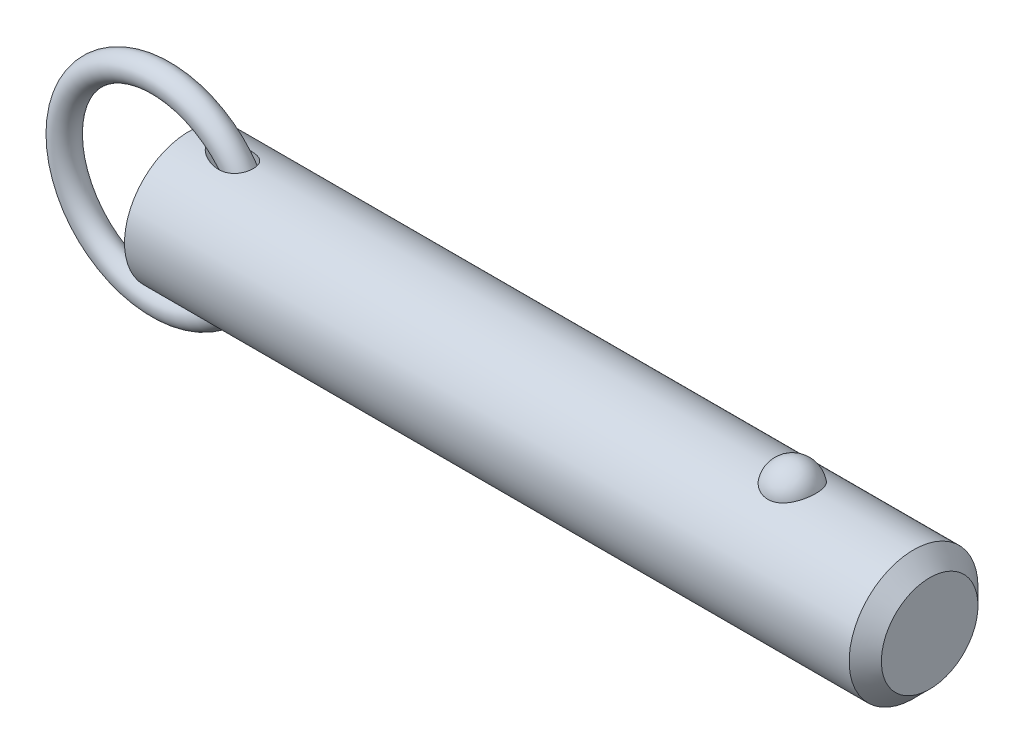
ISO-10303-21;
HEADER;
FILE_DESCRIPTION(('STEP AP214'),'2;1');
FILE_NAME('part.step','',(''),(''),'','','');
FILE_SCHEMA(('AUTOMOTIVE_DESIGN { 1 0 10303 214 1 1 1 1 }'));
ENDSEC;
DATA;
#1=APPLICATION_CONTEXT('core data for automotive mechanical design processes');
#2=APPLICATION_PROTOCOL_DEFINITION('international standard','automotive_design',2000,#1);
#3=PRODUCT_CONTEXT('',#1,'mechanical');
#4=PRODUCT('Part','Part','',(#3));
#5=PRODUCT_RELATED_PRODUCT_CATEGORY('part','',(#4));
#6=PRODUCT_DEFINITION_FORMATION('','',#4);
#7=PRODUCT_DEFINITION_CONTEXT('part definition',#1,'design');
#8=PRODUCT_DEFINITION('design','',#6,#7);
#9=PRODUCT_DEFINITION_SHAPE('','',#8);
#10=(LENGTH_UNIT() NAMED_UNIT(*) SI_UNIT(.MILLI.,.METRE.));
#11=(NAMED_UNIT(*) PLANE_ANGLE_UNIT() SI_UNIT($,.RADIAN.));
#12=(NAMED_UNIT(*) SI_UNIT($,.STERADIAN.) SOLID_ANGLE_UNIT());
#13=UNCERTAINTY_MEASURE_WITH_UNIT(LENGTH_MEASURE(1.E-05),#10,'distance_accuracy_value','');
#14=(GEOMETRIC_REPRESENTATION_CONTEXT(3) GLOBAL_UNCERTAINTY_ASSIGNED_CONTEXT((#13)) GLOBAL_UNIT_ASSIGNED_CONTEXT((#10,
#11,#12)) REPRESENTATION_CONTEXT('',''));
#15=CARTESIAN_POINT('',(0.,0.,0.));
#16=DIRECTION('',(0.,0.,1.));
#17=DIRECTION('',(1.,0.,0.));
#18=AXIS2_PLACEMENT_3D('',#15,#16,#17);
#19=CARTESIAN_POINT('',(-5.53898640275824,0.,0.));
#20=DIRECTION('',(0.,0.,1.));
#21=DIRECTION('',(1.,0.,0.));
#22=AXIS2_PLACEMENT_3D('',#19,#20,#21);
#23=TOROIDAL_SURFACE('',#22,19.05,2.54);
#24=CARTESIAN_POINT('',(16.0510135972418,0.,0.));
#25=VERTEX_POINT('',#24);
#26=VERTEX_LOOP('',#25);
#27=FACE_BOUND('',#26,.T.);
#28=ADVANCED_FACE('P0_F12',(#27),#23,.T.);
#29=CLOSED_SHELL('',(#28));
#30=MANIFOLD_SOLID_BREP('P0_B1',#29);
#31=CARTESIAN_POINT('',(0.,0.,0.));
#32=DIRECTION('',(1.,0.,0.));
#33=DIRECTION('',(0.,0.,-1.));
#34=AXIS2_PLACEMENT_3D('',#31,#32,#33);
#35=CYLINDRICAL_SURFACE('',#34,12.7);
#36=CARTESIAN_POINT('',(142.875,0.,0.));
#37=DIRECTION('',(1.,0.,0.));
#38=DIRECTION('',(0.,0.,-1.));
#39=AXIS2_PLACEMENT_3D('',#36,#37,#38);
#40=CIRCLE('',#39,12.7);
#41=CARTESIAN_POINT('',(142.875,0.,-12.7));
#42=VERTEX_POINT('',#41);
#43=EDGE_CURVE('P1_E89',#42,#42,#40,.T.);
#44=ORIENTED_EDGE('',*,*,#43,.F.);
#45=EDGE_LOOP('',(#44));
#46=FACE_BOUND('',#45,.T.);
#47=CARTESIAN_POINT('',(0.,0.,0.));
#48=DIRECTION('',(1.,0.,0.));
#49=DIRECTION('',(0.,0.,-1.));
#50=AXIS2_PLACEMENT_3D('',#47,#48,#49);
#51=CIRCLE('',#50,12.7);
#52=CARTESIAN_POINT('',(0.,0.,-12.7));
#53=VERTEX_POINT('',#52);
#54=EDGE_CURVE('P1_E52',#53,#53,#51,.T.);
#55=ORIENTED_EDGE('',*,*,#54,.T.);
#56=EDGE_LOOP('',(#55));
#57=FACE_BOUND('',#56,.T.);
#58=CARTESIAN_POINT('',(118.960042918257,11.7500437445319,4.81938502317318));
#59=CARTESIAN_POINT('',(118.835088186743,11.7500430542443,4.81938571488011));
#60=CARTESIAN_POINT('',(118.710144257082,11.7520975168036,4.81438658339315));
#61=CARTESIAN_POINT('',(118.461142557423,11.760253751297,4.79442904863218));
#62=CARTESIAN_POINT('',(118.337085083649,11.7663568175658,4.77946746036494));
#63=CARTESIAN_POINT('',(118.090901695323,11.7824262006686,4.7397141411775));
#64=CARTESIAN_POINT('',(117.968774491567,11.7923898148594,4.71492928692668));
#65=CARTESIAN_POINT('',(117.727187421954,11.8158938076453,4.65571340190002));
#66=CARTESIAN_POINT('',(117.60772859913,11.8294355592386,4.6212786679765));
#67=CARTESIAN_POINT('',(117.372557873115,11.8596812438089,4.54309502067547));
#68=CARTESIAN_POINT('',(117.256839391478,11.8763792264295,4.49936361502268));
#69=CARTESIAN_POINT('',(117.029653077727,11.9124878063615,4.40287235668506));
#70=CARTESIAN_POINT('',(116.918186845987,11.9318994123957,4.35010914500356));
#71=CARTESIAN_POINT('',(116.591278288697,11.9934256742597,4.17881316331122));
#72=CARTESIAN_POINT('',(116.383127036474,12.038858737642,4.04720756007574));
#73=CARTESIAN_POINT('',(115.985850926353,12.1352173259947,3.748564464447));
#74=CARTESIAN_POINT('',(115.797443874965,12.1862630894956,3.58061821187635));
#75=CARTESIAN_POINT('',(115.450521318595,12.2875163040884,3.21600758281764));
#76=CARTESIAN_POINT('',(115.292011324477,12.3377235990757,3.0193379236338));
#77=CARTESIAN_POINT('',(115.00168878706,12.434492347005,2.592916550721));
#78=CARTESIAN_POINT('',(114.871376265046,12.4807925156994,2.36208286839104));
#79=CARTESIAN_POINT('',(114.649407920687,12.5623454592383,1.88070399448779));
#80=CARTESIAN_POINT('',(114.557755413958,12.5975972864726,1.63015711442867));
#81=CARTESIAN_POINT('',(114.414046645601,12.6538414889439,1.1129886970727));
#82=CARTESIAN_POINT('',(114.362499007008,12.6746503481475,0.846205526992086));
#83=CARTESIAN_POINT('',(114.301977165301,12.699153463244,0.307085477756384));
#84=CARTESIAN_POINT('',(114.293001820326,12.7028481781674,0.0347487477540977));
#85=CARTESIAN_POINT('',(114.317731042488,12.6927785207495,-0.506073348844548));
#86=CARTESIAN_POINT('',(114.351189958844,12.6791146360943,-0.77457186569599));
#87=CARTESIAN_POINT('',(114.459687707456,12.635882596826,-1.30170246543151));
#88=CARTESIAN_POINT('',(114.53472729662,12.606314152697,-1.5603343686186));
#89=CARTESIAN_POINT('',(114.72500006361,12.5342328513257,-2.06083899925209));
#90=CARTESIAN_POINT('',(114.840287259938,12.4917026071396,-2.3026886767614));
#91=CARTESIAN_POINT('',(115.108704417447,12.3981123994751,-2.76259600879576));
#92=CARTESIAN_POINT('',(115.261837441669,12.3470517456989,-2.98065173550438));
#93=CARTESIAN_POINT('',(115.603507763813,12.2416045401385,-3.38786328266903));
#94=CARTESIAN_POINT('',(115.792201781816,12.1872040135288,-3.57688418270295));
#95=CARTESIAN_POINT('',(116.200239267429,12.0814086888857,-3.91941073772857));
#96=CARTESIAN_POINT('',(116.419580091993,12.0300136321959,-4.07291945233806));
#97=CARTESIAN_POINT('',(116.878375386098,11.9373542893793,-4.33691289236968));
#98=CARTESIAN_POINT('',(117.117304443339,11.8958982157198,-4.44824125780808));
#99=CARTESIAN_POINT('',(117.61243761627,11.8268116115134,-4.62881985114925));
#100=CARTESIAN_POINT('',(117.868635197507,11.7991758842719,-4.69808589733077));
#101=CARTESIAN_POINT('',(118.377164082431,11.7622209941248,-4.78983181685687));
#102=CARTESIAN_POINT('',(118.629041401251,11.7520502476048,-4.81449025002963));
#103=CARTESIAN_POINT('',(119.133573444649,11.7485796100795,-4.82295735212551));
#104=CARTESIAN_POINT('',(119.386228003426,11.7552763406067,-4.80677420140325));
#105=CARTESIAN_POINT('',(119.876834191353,11.7842584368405,-4.73525430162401));
#106=CARTESIAN_POINT('',(120.114998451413,11.8060486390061,-4.68116061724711));
#107=CARTESIAN_POINT('',(120.578489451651,11.8622750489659,-4.53678133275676));
#108=CARTESIAN_POINT('',(120.803815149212,11.8967122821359,-4.44649279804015));
#109=CARTESIAN_POINT('',(121.240801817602,11.9754603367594,-4.2298761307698));
#110=CARTESIAN_POINT('',(121.452057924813,12.0199699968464,-4.10280539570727));
#111=CARTESIAN_POINT('',(121.850601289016,12.1138028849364,-3.81685409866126));
#112=CARTESIAN_POINT('',(122.037883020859,12.163127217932,-3.65796622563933));
#113=CARTESIAN_POINT('',(122.393350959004,12.2642343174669,-3.30364864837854));
#114=CARTESIAN_POINT('',(122.560111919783,12.3160165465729,-3.10678783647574));
#115=CARTESIAN_POINT('',(122.859579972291,12.4142566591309,-2.68748409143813));
#116=CARTESIAN_POINT('',(122.992280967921,12.4607135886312,-2.46503658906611));
#117=CARTESIAN_POINT('',(123.224691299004,12.5450236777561,-1.9928951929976));
#118=CARTESIAN_POINT('',(123.323215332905,12.5825557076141,-1.7425591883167));
#119=CARTESIAN_POINT('',(123.479227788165,12.6431720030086,-1.22773734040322));
#120=CARTESIAN_POINT('',(123.536715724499,12.6662560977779,-0.963251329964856));
#121=CARTESIAN_POINT('',(123.609544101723,12.6956486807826,-0.427355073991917));
#122=CARTESIAN_POINT('',(123.624837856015,12.7019385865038,-0.155937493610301));
#123=CARTESIAN_POINT('',(123.612779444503,12.6970201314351,0.385928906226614));
#124=CARTESIAN_POINT('',(123.58542805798,12.6858120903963,0.656377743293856));
#125=CARTESIAN_POINT('',(123.513060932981,12.6568455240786,1.05454017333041));
#126=CARTESIAN_POINT('',(123.483796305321,12.6451962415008,1.18577850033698));
#127=CARTESIAN_POINT('',(123.415022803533,12.6181819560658,1.44513808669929));
#128=CARTESIAN_POINT('',(123.375517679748,12.6028183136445,1.57326046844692));
#129=CARTESIAN_POINT('',(123.286439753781,12.5687547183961,1.82554978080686));
#130=CARTESIAN_POINT('',(123.236862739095,12.5500533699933,1.9497150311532));
#131=CARTESIAN_POINT('',(123.12792115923,12.5098093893,2.1931437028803));
#132=CARTESIAN_POINT('',(123.068560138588,12.4882677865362,2.31240887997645));
#133=CARTESIAN_POINT('',(122.93997128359,12.4427679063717,2.54593031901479));
#134=CARTESIAN_POINT('',(122.870688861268,12.4187964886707,2.66015396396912));
#135=CARTESIAN_POINT('',(122.722903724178,12.3691892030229,2.88202659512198));
#136=CARTESIAN_POINT('',(122.644404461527,12.3435539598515,2.98967802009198));
#137=CARTESIAN_POINT('',(122.478550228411,12.2912955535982,3.19774385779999));
#138=CARTESIAN_POINT('',(122.391191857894,12.2646720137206,3.29815546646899));
#139=CARTESIAN_POINT('',(122.208161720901,12.2111945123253,3.49095035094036));
#140=CARTESIAN_POINT('',(122.112493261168,12.1843406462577,3.58333679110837));
#141=CARTESIAN_POINT('',(121.913627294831,12.1312249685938,3.75922876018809));
#142=CARTESIAN_POINT('',(121.810450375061,12.104961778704,3.84275713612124));
#143=CARTESIAN_POINT('',(121.59701336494,12.0537284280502,4.00056406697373));
#144=CARTESIAN_POINT('',(121.486756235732,12.028757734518,4.07484645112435));
#145=CARTESIAN_POINT('',(121.259755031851,11.9808306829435,4.21367959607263));
#146=CARTESIAN_POINT('',(121.143006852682,11.9578756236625,4.27822410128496));
#147=CARTESIAN_POINT('',(120.90394258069,11.9147184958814,4.39698483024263));
#148=CARTESIAN_POINT('',(120.781628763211,11.894515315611,4.45120522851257));
#149=CARTESIAN_POINT('',(120.522952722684,11.8561129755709,4.55255353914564));
#150=CARTESIAN_POINT('',(120.386223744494,11.8381764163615,4.59884858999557));
#151=CARTESIAN_POINT('',(120.108608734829,11.8069093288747,4.67853897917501));
#152=CARTESIAN_POINT('',(119.967724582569,11.7935767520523,4.71194005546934));
#153=CARTESIAN_POINT('',(119.68309446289,11.7720277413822,4.76552188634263));
#154=CARTESIAN_POINT('',(119.539348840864,11.7638106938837,4.78570422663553));
#155=CARTESIAN_POINT('',(119.250411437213,11.7528195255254,4.81263433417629));
#156=CARTESIAN_POINT('',(119.105219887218,11.7500445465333,4.81938421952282));
#157=CARTESIAN_POINT('',(118.960042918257,11.7500437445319,4.81938502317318));
#158=B_SPLINE_CURVE_WITH_KNOTS('',3,(#58,#59,#60,#61,#62,#63,#64,#65,#66,#67,#68,#69,#70,#71,
#72,#73,#74,#75,#76,#77,#78,#79,#80,#81,#82,#83,#84,#85,#86,#87,#88,#89,#90,#91,#92,#93,#94,#95,
#96,#97,#98,#99,#100,#101,#102,#103,#104,#105,#106,#107,#108,#109,#110,#111,#112,#113,#114,#115,
#116,#117,#118,#119,#120,#121,#122,#123,#124,#125,#126,#127,#128,#129,#130,#131,#132,#133,#134,
#135,#136,#137,#138,#139,#140,#141,#142,#143,#144,#145,#146,#147,#148,#149,#150,#151,#152,#153,
#154,#155,#156,#157),.UNSPECIFIED.,.T.,.F.,(4,2,2,2,2,2,2,2,2,2,2,2,2,2,2,2,2,2,2,2,2,2,2,2,2,2,
2,2,2,2,2,2,2,2,2,2,2,2,2,2,2,2,2,2,2,2,2,2,2,4),(0.,0.374729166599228,0.749578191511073,
1.12416526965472,1.49889629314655,1.87292776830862,2.24709865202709,2.99481328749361,
3.76399449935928,4.53331735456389,5.3368391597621,6.14042986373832,6.95405296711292,
7.76765424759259,8.57656703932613,9.38549455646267,10.1955119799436,11.0055949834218,
11.8193353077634,12.6330054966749,13.4294141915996,14.2255231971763,14.9815786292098,
15.7374826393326,16.4696948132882,17.2019663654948,17.9501979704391,18.6986017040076,
19.484470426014,20.2704797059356,21.0815215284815,21.8925729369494,22.7045213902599,
23.5164550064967,23.9209608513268,24.3253187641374,24.7298461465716,25.1342272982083,
25.54092555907,25.9474719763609,26.3541750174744,26.7607169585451,27.1661834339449,
27.5714814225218,27.9770386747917,28.3824315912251,28.8181206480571,29.2536155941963,
29.6890582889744,30.1244323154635),.UNSPECIFIED.);
#159=CARTESIAN_POINT('',(118.960042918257,11.7500437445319,4.81938502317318));
#160=VERTEX_POINT('',#159);
#161=EDGE_CURVE('P1_E80',#160,#160,#158,.T.);
#162=ORIENTED_EDGE('',*,*,#161,.T.);
#163=EDGE_LOOP('',(#162));
#164=FACE_BOUND('',#163,.T.);
#165=CARTESIAN_POINT('',(-5.53898640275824,0.,0.));
#166=DIRECTION('',(0.796400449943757,-0.604769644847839,0.));
#167=DIRECTION('',(0.604769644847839,0.796400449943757,0.));
#168=AXIS2_PLACEMENT_3D('',#165,#166,#167);
#169=ELLIPSE('',#168,15.9467514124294,12.7);
#170=CARTESIAN_POINT('',(4.09482149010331,12.6864319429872,0.586893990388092));
#171=VERTEX_POINT('',#170);
#172=CARTESIAN_POINT('',(4.09482149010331,12.6864319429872,-0.586893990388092));
#173=VERTEX_POINT('',#172);
#174=EDGE_CURVE('P1_E47',#171,#173,#169,.F.);
#175=ORIENTED_EDGE('',*,*,#174,.T.);
#176=CARTESIAN_POINT('',(4.06153170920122,12.6905758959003,-0.48916605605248));
#177=CARTESIAN_POINT('',(4.08111374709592,12.6881366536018,-0.552489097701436));
#178=CARTESIAN_POINT('',(4.10417851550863,12.6852663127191,-0.614604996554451));
#179=CARTESIAN_POINT('',(4.1562843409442,12.6787965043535,-0.736067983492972));
#180=CARTESIAN_POINT('',(4.18531032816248,12.6751988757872,-0.795421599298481));
#181=CARTESIAN_POINT('',(4.27911159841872,12.6636052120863,-0.967590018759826));
#182=CARTESIAN_POINT('',(4.35123408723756,12.654730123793,-1.07635920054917));
#183=CARTESIAN_POINT('',(4.49106800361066,12.6376715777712,-1.25922957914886));
#184=CARTESIAN_POINT('',(4.5560106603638,12.6297947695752,-1.33556751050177));
#185=CARTESIAN_POINT('',(4.69223626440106,12.6134116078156,-1.48232741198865));
#186=CARTESIAN_POINT('',(4.7635214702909,12.6049050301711,-1.55274725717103));
#187=CARTESIAN_POINT('',(4.91163946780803,12.587417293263,-1.68868704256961));
#188=CARTESIAN_POINT('',(4.98851399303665,12.5784327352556,-1.75416062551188));
#189=CARTESIAN_POINT('',(5.14630057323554,12.560235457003,-1.88003275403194));
#190=CARTESIAN_POINT('',(5.22721398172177,12.5510226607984,-1.94042957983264));
#191=CARTESIAN_POINT('',(5.45368877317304,12.5256514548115,-2.09966332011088));
#192=CARTESIAN_POINT('',(5.60261616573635,12.5094182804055,-2.19371988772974));
#193=CARTESIAN_POINT('',(5.90795545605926,12.4774211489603,-2.36893890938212));
#194=CARTESIAN_POINT('',(6.06437232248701,12.4616575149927,-2.45009264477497));
#195=CARTESIAN_POINT('',(6.38306132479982,12.431227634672,-2.60008249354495));
#196=CARTESIAN_POINT('',(6.54533237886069,12.4165611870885,-2.66892086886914));
#197=CARTESIAN_POINT('',(6.87462618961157,12.3889351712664,-2.79435199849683));
#198=CARTESIAN_POINT('',(7.0416477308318,12.3759751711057,-2.85094785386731));
#199=CARTESIAN_POINT('',(7.38726647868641,12.3518460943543,-2.95377962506));
#200=CARTESIAN_POINT('',(7.56604577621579,12.3407843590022,-2.9994320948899));
#201=CARTESIAN_POINT('',(7.92698692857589,12.3219309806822,-3.07596683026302));
#202=CARTESIAN_POINT('',(8.10914972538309,12.314140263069,-3.1068449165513));
#203=CARTESIAN_POINT('',(8.47511457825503,12.3025918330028,-3.15226850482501));
#204=CARTESIAN_POINT('',(8.6589097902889,12.2988216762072,-3.16686440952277));
#205=CARTESIAN_POINT('',(9.02696087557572,12.2959421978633,-3.17802250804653));
#206=CARTESIAN_POINT('',(9.21121628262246,12.2968292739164,-3.17459864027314));
#207=CARTESIAN_POINT('',(9.61636263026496,12.3045198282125,-3.14471110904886));
#208=CARTESIAN_POINT('',(9.83695552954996,12.3125080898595,-3.1136323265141));
#209=CARTESIAN_POINT('',(10.1619126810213,12.3303028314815,-3.04206574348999));
#210=CARTESIAN_POINT('',(10.2692747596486,12.3372061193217,-3.01403983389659));
#211=CARTESIAN_POINT('',(10.4811758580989,12.3528538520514,-2.94925947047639));
#212=CARTESIAN_POINT('',(10.5857162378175,12.361597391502,-2.91250930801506));
#213=CARTESIAN_POINT('',(10.7921321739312,12.3808585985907,-2.82951748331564));
#214=CARTESIAN_POINT('',(10.8939665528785,12.3913944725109,-2.78317723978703));
#215=CARTESIAN_POINT('',(11.0926118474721,12.4138762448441,-2.68112002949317));
#216=CARTESIAN_POINT('',(11.1894254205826,12.4258213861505,-2.62540809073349));
#217=CARTESIAN_POINT('',(11.3768740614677,12.4507225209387,-2.50465655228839));
#218=CARTESIAN_POINT('',(11.46751150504,12.4636781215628,-2.43962056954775));
#219=CARTESIAN_POINT('',(11.641457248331,12.4901070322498,-2.30048560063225));
#220=CARTESIAN_POINT('',(11.7247669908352,12.5035802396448,-2.2263884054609));
#221=CARTESIAN_POINT('',(11.8713131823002,12.5285000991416,-2.08117367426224));
#222=CARTESIAN_POINT('',(11.9357009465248,12.5399538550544,-2.0112159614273));
#223=CARTESIAN_POINT('',(12.0576805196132,12.5624496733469,-1.86555293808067));
#224=CARTESIAN_POINT('',(12.1152732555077,12.5734917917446,-1.7898484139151));
#225=CARTESIAN_POINT('',(12.2230738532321,12.5947858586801,-1.63327883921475));
#226=CARTESIAN_POINT('',(12.2732844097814,12.6050380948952,-1.55241568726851));
#227=CARTESIAN_POINT('',(12.3658430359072,12.6243983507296,-1.38621267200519));
#228=CARTESIAN_POINT('',(12.4081916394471,12.6335064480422,-1.30087311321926));
#229=CARTESIAN_POINT('',(12.5150098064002,12.6569076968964,-1.05702619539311));
#230=CARTESIAN_POINT('',(12.5703399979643,12.6695746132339,-0.894232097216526));
#231=CARTESIAN_POINT('',(12.6526225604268,12.6886816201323,-0.561391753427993));
#232=CARTESIAN_POINT('',(12.6795825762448,12.6951233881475,-0.391347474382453));
#233=CARTESIAN_POINT('',(12.7041016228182,12.7009766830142,-0.0537636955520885));
#234=CARTESIAN_POINT('',(12.7024538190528,12.7005778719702,0.113714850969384));
#235=CARTESIAN_POINT('',(12.6717240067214,12.6932548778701,0.445979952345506));
#236=CARTESIAN_POINT('',(12.6426435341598,12.6863310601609,0.61076665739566));
#237=CARTESIAN_POINT('',(12.5579769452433,12.6667465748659,0.932429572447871));
#238=CARTESIAN_POINT('',(12.5024793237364,12.6541050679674,1.08933027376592));
#239=CARTESIAN_POINT('',(12.3665691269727,12.6244558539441,1.39146752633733));
#240=CARTESIAN_POINT('',(12.2861577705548,12.6074483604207,1.53670464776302));
#241=CARTESIAN_POINT('',(12.1018203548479,12.5706804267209,1.81319588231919));
#242=CARTESIAN_POINT('',(11.9976588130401,12.5508932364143,1.94428915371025));
#243=CARTESIAN_POINT('',(11.7695265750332,12.5107540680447,2.18776051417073));
#244=CARTESIAN_POINT('',(11.6455540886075,12.4904020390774,2.30013691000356));
#245=CARTESIAN_POINT('',(11.3759347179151,12.4502278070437,2.50870972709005));
#246=CARTESIAN_POINT('',(11.2295880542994,12.4304654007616,2.60400962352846));
#247=CARTESIAN_POINT('',(10.9239803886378,12.3941696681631,2.7716292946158));
#248=CARTESIAN_POINT('',(10.7647152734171,12.3776373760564,2.84394171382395));
#249=CARTESIAN_POINT('',(10.4192039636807,12.3473062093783,2.9730352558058));
#250=CARTESIAN_POINT('',(10.231933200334,12.3340204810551,3.02717164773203));
#251=CARTESIAN_POINT('',(9.85152982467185,12.3134301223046,3.10986173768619));
#252=CARTESIAN_POINT('',(9.65839336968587,12.3061295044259,3.13839827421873));
#253=CARTESIAN_POINT('',(9.31022514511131,12.2982822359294,3.16897517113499));
#254=CARTESIAN_POINT('',(9.15555718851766,12.2966525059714,3.1752689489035));
#255=CARTESIAN_POINT('',(8.84618945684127,12.2967963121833,3.17471335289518));
#256=CARTESIAN_POINT('',(8.69148970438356,12.2985715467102,3.16785742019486));
#257=CARTESIAN_POINT('',(8.38280471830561,12.3051648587,3.14214692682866));
#258=CARTESIAN_POINT('',(8.22882218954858,12.3099904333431,3.12326280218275));
#259=CARTESIAN_POINT('',(7.92276070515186,12.3222644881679,3.07448013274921));
#260=CARTESIAN_POINT('',(7.77068148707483,12.3297126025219,3.04458312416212));
#261=CARTESIAN_POINT('',(7.46452663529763,12.3470493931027,2.97350781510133));
#262=CARTESIAN_POINT('',(7.31052714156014,12.3570043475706,2.93201910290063));
#263=CARTESIAN_POINT('',(7.00579083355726,12.3787609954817,2.83876185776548));
#264=CARTESIAN_POINT('',(6.85505451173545,12.3905629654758,2.78699178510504));
#265=CARTESIAN_POINT('',(6.55781208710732,12.415528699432,2.6735774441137));
#266=CARTESIAN_POINT('',(6.41129783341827,12.4286895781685,2.61195394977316));
#267=CARTESIAN_POINT('',(6.12302950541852,12.4559398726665,2.47874512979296));
#268=CARTESIAN_POINT('',(5.981273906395,12.4700289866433,2.40716303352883));
#269=CARTESIAN_POINT('',(5.6707312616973,12.5020754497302,2.2355042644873));
#270=CARTESIAN_POINT('',(5.50343839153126,12.5201625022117,2.13268685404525));
#271=CARTESIAN_POINT('',(5.26147616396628,12.5471537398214,1.96522579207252));
#272=CARTESIAN_POINT('',(5.18224299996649,12.5561365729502,1.90713440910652));
#273=CARTESIAN_POINT('',(5.02746475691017,12.573912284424,1.78618989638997));
#274=CARTESIAN_POINT('',(4.95191912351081,12.5827051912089,1.72333748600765));
#275=CARTESIAN_POINT('',(4.81787163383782,12.598469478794,1.60360864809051));
#276=CARTESIAN_POINT('',(4.75865966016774,12.6054958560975,1.54753994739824));
#277=CARTESIAN_POINT('',(4.64406285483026,12.6191906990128,1.43158546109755));
#278=CARTESIAN_POINT('',(4.5886792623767,12.6258590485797,1.37169845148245));
#279=CARTESIAN_POINT('',(4.43014912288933,12.6450546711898,1.18656670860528));
#280=CARTESIAN_POINT('',(4.3337272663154,12.6568788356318,1.05507993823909));
#281=CARTESIAN_POINT('',(4.21252055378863,12.6718304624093,0.848052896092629));
#282=CARTESIAN_POINT('',(4.17660155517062,12.6762773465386,0.779100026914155));
#283=CARTESIAN_POINT('',(4.11264979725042,12.6842122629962,0.637080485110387));
#284=CARTESIAN_POINT('',(4.08466792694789,12.6876941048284,0.563990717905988));
#285=CARTESIAN_POINT('',(4.06153170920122,12.6905758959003,0.4891660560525));
#286=B_SPLINE_CURVE_WITH_KNOTS('',3,(#176,#177,#178,#179,#180,#181,#182,#183,#184,#185,#186,
#187,#188,#189,#190,#191,#192,#193,#194,#195,#196,#197,#198,#199,#200,#201,#202,#203,#204,#205,
#206,#207,#208,#209,#210,#211,#212,#213,#214,#215,#216,#217,#218,#219,#220,#221,#222,#223,#224,
#225,#226,#227,#228,#229,#230,#231,#232,#233,#234,#235,#236,#237,#238,#239,#240,#241,#242,#243,
#244,#245,#246,#247,#248,#249,#250,#251,#252,#253,#254,#255,#256,#257,#258,#259,#260,#261,#262,
#263,#264,#265,#266,#267,#268,#269,#270,#271,#272,#273,#274,#275,#276,#277,#278,#279,#280,#281,
#282,#283,#284,#285),.UNSPECIFIED.,.F.,.F.,(4,2,2,2,2,2,2,2,2,2,2,2,2,2,2,2,2,2,2,2,2,2,2,2,2,2,
2,2,2,2,2,2,2,2,2,2,2,2,2,2,2,2,2,2,2,2,2,2,2,2,2,2,2,2,4),(0.,0.198708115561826,
0.39691995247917,0.787580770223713,1.08882492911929,1.39017679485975,1.69407136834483,
1.99806847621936,2.52793143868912,3.05815092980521,3.58827293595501,4.11826050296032,
4.67218806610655,5.22627222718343,5.77863637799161,6.3305733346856,6.99657211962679,
7.32977411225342,7.66281254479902,7.99946156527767,8.33593054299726,8.67226935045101,
9.00854178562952,9.29544181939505,9.58230266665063,9.86905853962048,10.1557949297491,
10.6702338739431,11.1845341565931,11.6845985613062,12.1846349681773,12.6830079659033,
13.1813565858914,13.68487951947,14.1884479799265,14.713533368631,15.2387866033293,
15.8228373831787,16.407279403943,16.8710810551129,17.3351141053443,17.8002921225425,
18.2654052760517,18.7444169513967,19.2235004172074,19.7015868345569,20.1795185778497,
20.7699825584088,21.0658110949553,21.3615950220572,21.606957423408,21.8523988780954,
22.3397467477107,22.5729183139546,22.8075527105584),.UNSPECIFIED.);
#287=EDGE_CURVE('P1_E51',#173,#171,#286,.T.);
#288=ORIENTED_EDGE('',*,*,#287,.T.);
#289=EDGE_LOOP('',(#175,#288));
#290=FACE_BOUND('',#289,.T.);
#291=CARTESIAN_POINT('',(-5.53898640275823,0.,0.));
#292=DIRECTION('',(-0.796400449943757,-0.604769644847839,0.));
#293=DIRECTION('',(0.604769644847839,-0.796400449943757,0.));
#294=AXIS2_PLACEMENT_3D('',#291,#292,#293);
#295=ELLIPSE('',#294,15.9467514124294,12.7);
#296=CARTESIAN_POINT('',(4.09482149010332,-12.6864319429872,0.586893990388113));
#297=VERTEX_POINT('',#296);
#298=CARTESIAN_POINT('',(4.09482149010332,-12.6864319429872,-0.586893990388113));
#299=VERTEX_POINT('',#298);
#300=EDGE_CURVE('P1_E28',#297,#299,#295,.F.);
#301=ORIENTED_EDGE('',*,*,#300,.F.);
#302=CARTESIAN_POINT('',(4.06153170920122,-12.6905758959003,0.489166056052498));
#303=CARTESIAN_POINT('',(4.08111374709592,-12.6881366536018,0.552489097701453));
#304=CARTESIAN_POINT('',(4.10417851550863,-12.6852663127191,0.614604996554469));
#305=CARTESIAN_POINT('',(4.15628434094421,-12.6787965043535,0.736067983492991));
#306=CARTESIAN_POINT('',(4.18531032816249,-12.6751988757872,0.795421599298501));
#307=CARTESIAN_POINT('',(4.27911159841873,-12.6636052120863,0.967590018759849));
#308=CARTESIAN_POINT('',(4.35123408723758,-12.654730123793,1.07635920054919));
#309=CARTESIAN_POINT('',(4.49106800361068,-12.6376715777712,1.25922957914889));
#310=CARTESIAN_POINT('',(4.55601066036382,-12.6297947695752,1.3355675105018));
#311=CARTESIAN_POINT('',(4.69223626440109,-12.6134116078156,1.48232741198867));
#312=CARTESIAN_POINT('',(4.76352147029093,-12.6049050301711,1.55274725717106));
#313=CARTESIAN_POINT('',(4.91163946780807,-12.587417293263,1.68868704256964));
#314=CARTESIAN_POINT('',(4.98851399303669,-12.5784327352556,1.75416062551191));
#315=CARTESIAN_POINT('',(5.14630057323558,-12.560235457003,1.88003275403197));
#316=CARTESIAN_POINT('',(5.22721398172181,-12.5510226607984,1.94042957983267));
#317=CARTESIAN_POINT('',(5.45368877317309,-12.5256514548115,2.09966332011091));
#318=CARTESIAN_POINT('',(5.60261616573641,-12.5094182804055,2.19371988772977));
#319=CARTESIAN_POINT('',(5.90795545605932,-12.4774211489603,2.36893890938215));
#320=CARTESIAN_POINT('',(6.06437232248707,-12.4616575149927,2.450092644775));
#321=CARTESIAN_POINT('',(6.38306132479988,-12.431227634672,2.60008249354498));
#322=CARTESIAN_POINT('',(6.54533237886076,-12.4165611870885,2.66892086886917));
#323=CARTESIAN_POINT('',(6.87462618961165,-12.3889351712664,2.79435199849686));
#324=CARTESIAN_POINT('',(7.04164773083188,-12.3759751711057,2.85094785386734));
#325=CARTESIAN_POINT('',(7.38726647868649,-12.3518460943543,2.95377962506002));
#326=CARTESIAN_POINT('',(7.56604577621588,-12.3407843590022,2.99943209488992));
#327=CARTESIAN_POINT('',(7.92698692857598,-12.3219309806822,3.07596683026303));
#328=CARTESIAN_POINT('',(8.10914972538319,-12.314140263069,3.10684491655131));
#329=CARTESIAN_POINT('',(8.47511457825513,-12.3025918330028,3.15226850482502));
#330=CARTESIAN_POINT('',(8.65890979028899,-12.2988216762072,3.16686440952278));
#331=CARTESIAN_POINT('',(9.02696087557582,-12.2959421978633,3.17802250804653));
#332=CARTESIAN_POINT('',(9.21121628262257,-12.2968292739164,3.17459864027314));
#333=CARTESIAN_POINT('',(9.61636263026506,-12.3045198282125,3.14471110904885));
#334=CARTESIAN_POINT('',(9.83695552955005,-12.3125080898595,3.11363232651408));
#335=CARTESIAN_POINT('',(10.1619126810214,-12.3303028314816,3.04206574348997));
#336=CARTESIAN_POINT('',(10.2692747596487,-12.3372061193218,3.01403983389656));
#337=CARTESIAN_POINT('',(10.481175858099,-12.3528538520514,2.94925947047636));
#338=CARTESIAN_POINT('',(10.5857162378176,-12.361597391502,2.91250930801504));
#339=CARTESIAN_POINT('',(10.7921321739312,-12.3808585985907,2.82951748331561));
#340=CARTESIAN_POINT('',(10.8939665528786,-12.3913944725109,2.78317723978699));
#341=CARTESIAN_POINT('',(11.0926118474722,-12.4138762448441,2.68112002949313));
#342=CARTESIAN_POINT('',(11.1894254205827,-12.4258213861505,2.62540809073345));
#343=CARTESIAN_POINT('',(11.3768740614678,-12.4507225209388,2.50465655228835));
#344=CARTESIAN_POINT('',(11.4675115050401,-12.4636781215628,2.4396205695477));
#345=CARTESIAN_POINT('',(11.641457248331,-12.4901070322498,2.3004856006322));
#346=CARTESIAN_POINT('',(11.7247669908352,-12.5035802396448,2.22638840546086));
#347=CARTESIAN_POINT('',(11.8713131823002,-12.5285000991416,2.0811736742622));
#348=CARTESIAN_POINT('',(11.9357009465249,-12.5399538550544,2.01121596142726));
#349=CARTESIAN_POINT('',(12.0576805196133,-12.5624496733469,1.86555293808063));
#350=CARTESIAN_POINT('',(12.1152732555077,-12.5734917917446,1.78984841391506));
#351=CARTESIAN_POINT('',(12.2230738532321,-12.5947858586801,1.63327883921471));
#352=CARTESIAN_POINT('',(12.2732844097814,-12.6050380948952,1.55241568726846));
#353=CARTESIAN_POINT('',(12.3658430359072,-12.6243983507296,1.38621267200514));
#354=CARTESIAN_POINT('',(12.4081916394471,-12.6335064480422,1.30087311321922));
#355=CARTESIAN_POINT('',(12.5150098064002,-12.6569076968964,1.05702619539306));
#356=CARTESIAN_POINT('',(12.5703399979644,-12.6695746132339,0.89423209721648));
#357=CARTESIAN_POINT('',(12.6526225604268,-12.6886816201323,0.561391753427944));
#358=CARTESIAN_POINT('',(12.6795825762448,-12.6951233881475,0.391347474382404));
#359=CARTESIAN_POINT('',(12.7041016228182,-12.7009766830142,0.0537636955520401));
#360=CARTESIAN_POINT('',(12.7024538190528,-12.7005778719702,-0.113714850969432));
#361=CARTESIAN_POINT('',(12.6717240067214,-12.6932548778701,-0.445979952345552));
#362=CARTESIAN_POINT('',(12.6426435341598,-12.6863310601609,-0.610766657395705));
#363=CARTESIAN_POINT('',(12.5579769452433,-12.6667465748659,-0.932429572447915));
#364=CARTESIAN_POINT('',(12.5024793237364,-12.6541050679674,-1.08933027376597));
#365=CARTESIAN_POINT('',(12.3665691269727,-12.6244558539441,-1.39146752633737));
#366=CARTESIAN_POINT('',(12.2861577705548,-12.6074483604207,-1.53670464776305));
#367=CARTESIAN_POINT('',(12.1018203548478,-12.5706804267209,-1.81319588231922));
#368=CARTESIAN_POINT('',(11.99765881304,-12.5508932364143,-1.94428915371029));
#369=CARTESIAN_POINT('',(11.7695265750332,-12.5107540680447,-2.18776051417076));
#370=CARTESIAN_POINT('',(11.6455540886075,-12.4904020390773,-2.30013691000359));
#371=CARTESIAN_POINT('',(11.375934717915,-12.4502278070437,-2.50870972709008));
#372=CARTESIAN_POINT('',(11.2295880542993,-12.4304654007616,-2.60400962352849));
#373=CARTESIAN_POINT('',(10.9239803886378,-12.3941696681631,-2.77162929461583));
#374=CARTESIAN_POINT('',(10.764715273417,-12.3776373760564,-2.84394171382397));
#375=CARTESIAN_POINT('',(10.4192039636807,-12.3473062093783,-2.97303525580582));
#376=CARTESIAN_POINT('',(10.2319332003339,-12.3340204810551,-3.02717164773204));
#377=CARTESIAN_POINT('',(9.8515298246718,-12.3134301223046,-3.1098617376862));
#378=CARTESIAN_POINT('',(9.65839336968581,-12.3061295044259,-3.13839827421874));
#379=CARTESIAN_POINT('',(9.31022514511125,-12.2982822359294,-3.168975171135));
#380=CARTESIAN_POINT('',(9.1555571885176,-12.2966525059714,-3.1752689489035));
#381=CARTESIAN_POINT('',(8.84618945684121,-12.2967963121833,-3.17471335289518));
#382=CARTESIAN_POINT('',(8.6914897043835,-12.2985715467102,-3.16785742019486));
#383=CARTESIAN_POINT('',(8.38280471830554,-12.3051648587,-3.14214692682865));
#384=CARTESIAN_POINT('',(8.22882218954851,-12.3099904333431,-3.12326280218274));
#385=CARTESIAN_POINT('',(7.92276070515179,-12.3222644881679,-3.07448013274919));
#386=CARTESIAN_POINT('',(7.77068148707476,-12.329712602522,-3.04458312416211));
#387=CARTESIAN_POINT('',(7.46452663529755,-12.3470493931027,-2.97350781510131));
#388=CARTESIAN_POINT('',(7.31052714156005,-12.3570043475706,-2.93201910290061));
#389=CARTESIAN_POINT('',(7.00579083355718,-12.3787609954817,-2.83876185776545));
#390=CARTESIAN_POINT('',(6.85505451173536,-12.3905629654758,-2.78699178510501));
#391=CARTESIAN_POINT('',(6.55781208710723,-12.415528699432,-2.67357744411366));
#392=CARTESIAN_POINT('',(6.41129783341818,-12.4286895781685,-2.61195394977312));
#393=CARTESIAN_POINT('',(6.12302950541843,-12.4559398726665,-2.47874512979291));
#394=CARTESIAN_POINT('',(5.9812739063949,-12.4700289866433,-2.40716303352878));
#395=CARTESIAN_POINT('',(5.6707312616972,-12.5020754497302,-2.23550426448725));
#396=CARTESIAN_POINT('',(5.50343839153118,-12.5201625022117,-2.13268685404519));
#397=CARTESIAN_POINT('',(5.2614761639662,-12.5471537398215,-1.96522579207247));
#398=CARTESIAN_POINT('',(5.18224299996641,-12.5561365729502,-1.90713440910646));
#399=CARTESIAN_POINT('',(5.0274647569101,-12.573912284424,-1.78618989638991));
#400=CARTESIAN_POINT('',(4.95191912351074,-12.5827051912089,-1.7233374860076));
#401=CARTESIAN_POINT('',(4.81787163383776,-12.598469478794,-1.60360864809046));
#402=CARTESIAN_POINT('',(4.75865966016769,-12.6054958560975,-1.54753994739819));
#403=CARTESIAN_POINT('',(4.64406285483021,-12.6191906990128,-1.43158546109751));
#404=CARTESIAN_POINT('',(4.58867926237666,-12.6258590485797,-1.37169845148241));
#405=CARTESIAN_POINT('',(4.43014912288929,-12.6450546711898,-1.18656670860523));
#406=CARTESIAN_POINT('',(4.33372726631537,-12.6568788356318,-1.05507993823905));
#407=CARTESIAN_POINT('',(4.2125205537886,-12.6718304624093,-0.848052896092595));
#408=CARTESIAN_POINT('',(4.17660155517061,-12.6762773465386,-0.779100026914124));
#409=CARTESIAN_POINT('',(4.11264979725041,-12.6842122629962,-0.637080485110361));
#410=CARTESIAN_POINT('',(4.08466792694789,-12.6876941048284,-0.563990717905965));
#411=CARTESIAN_POINT('',(4.06153170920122,-12.6905758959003,-0.489166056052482));
#412=B_SPLINE_CURVE_WITH_KNOTS('',3,(#302,#303,#304,#305,#306,#307,#308,#309,#310,#311,#312,
#313,#314,#315,#316,#317,#318,#319,#320,#321,#322,#323,#324,#325,#326,#327,#328,#329,#330,#331,
#332,#333,#334,#335,#336,#337,#338,#339,#340,#341,#342,#343,#344,#345,#346,#347,#348,#349,#350,
#351,#352,#353,#354,#355,#356,#357,#358,#359,#360,#361,#362,#363,#364,#365,#366,#367,#368,#369,
#370,#371,#372,#373,#374,#375,#376,#377,#378,#379,#380,#381,#382,#383,#384,#385,#386,#387,#388,
#389,#390,#391,#392,#393,#394,#395,#396,#397,#398,#399,#400,#401,#402,#403,#404,#405,#406,#407,
#408,#409,#410,#411),.UNSPECIFIED.,.F.,.F.,(4,2,2,2,2,2,2,2,2,2,2,2,2,2,2,2,2,2,2,2,2,2,2,2,2,2,
2,2,2,2,2,2,2,2,2,2,2,2,2,2,2,2,2,2,2,2,2,2,2,2,2,2,2,2,4),(0.,0.198708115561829,
0.396919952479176,0.787580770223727,1.08882492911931,1.39017679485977,1.69407136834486,
1.9980684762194,2.52793143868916,3.05815092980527,3.58827293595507,4.11826050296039,
4.67218806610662,5.22627222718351,5.77863637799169,6.33057333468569,6.99657211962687,
7.32977411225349,7.66281254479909,7.99946156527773,8.33593054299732,8.67226935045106,
9.00854178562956,9.29544181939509,9.58230266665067,9.86905853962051,10.1557949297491,
10.6702338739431,11.1845341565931,11.6845985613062,12.1846349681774,12.6830079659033,
13.1813565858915,13.68487951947,14.1884479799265,14.7135333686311,15.2387866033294,
15.8228373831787,16.4072794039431,16.871081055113,17.3351141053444,17.8002921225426,
18.2654052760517,18.7444169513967,19.2235004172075,19.701586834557,20.1795185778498,
20.7699825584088,21.0658110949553,21.3615950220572,21.606957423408,21.8523988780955,
22.3397467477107,22.5729183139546,22.8075527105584),.UNSPECIFIED.);
#413=EDGE_CURVE('P1_E10',#297,#299,#412,.T.);
#414=ORIENTED_EDGE('',*,*,#413,.T.);
#415=EDGE_LOOP('',(#301,#414));
#416=FACE_BOUND('',#415,.T.);
#417=ADVANCED_FACE('P1_F15',(#46,#57,#164,#290,#416),#35,.T.);
#418=CARTESIAN_POINT('',(0.,0.,0.));
#419=DIRECTION('',(-1.,0.,0.));
#420=DIRECTION('',(0.,0.,1.));
#421=AXIS2_PLACEMENT_3D('',#418,#419,#420);
#422=PLANE('',#421);
#423=ORIENTED_EDGE('',*,*,#54,.F.);
#424=EDGE_LOOP('',(#423));
#425=FACE_BOUND('',#424,.T.);
#426=ADVANCED_FACE('P1_F17',(#425),#422,.T.);
#427=CARTESIAN_POINT('',(146.05,0.,0.));
#428=DIRECTION('',(-1.,0.,0.));
#429=DIRECTION('',(0.,0.,1.));
#430=AXIS2_PLACEMENT_3D('',#427,#428,#429);
#431=CONICAL_SURFACE('',#430,9.52500000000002,0.785398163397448);
#432=ORIENTED_EDGE('',*,*,#43,.T.);
#433=EDGE_LOOP('',(#432));
#434=FACE_BOUND('',#433,.T.);
#435=CARTESIAN_POINT('',(146.05,0.,0.));
#436=DIRECTION('',(1.,0.,0.));
#437=DIRECTION('',(0.,0.,-1.));
#438=AXIS2_PLACEMENT_3D('',#435,#436,#437);
#439=CIRCLE('',#438,9.52500000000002);
#440=CARTESIAN_POINT('',(146.05,0.,-9.52500000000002));
#441=VERTEX_POINT('',#440);
#442=EDGE_CURVE('P1_E86',#441,#441,#439,.T.);
#443=ORIENTED_EDGE('',*,*,#442,.F.);
#444=EDGE_LOOP('',(#443));
#445=FACE_BOUND('',#444,.T.);
#446=ADVANCED_FACE('P1_F105',(#434,#445),#431,.T.);
#447=CARTESIAN_POINT('',(146.05,9.52500000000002,0.));
#448=DIRECTION('',(1.,0.,0.));
#449=DIRECTION('',(0.,0.,-1.));
#450=AXIS2_PLACEMENT_3D('',#447,#448,#449);
#451=PLANE('',#450);
#452=ORIENTED_EDGE('',*,*,#442,.T.);
#453=EDGE_LOOP('',(#452));
#454=FACE_BOUND('',#453,.T.);
#455=ADVANCED_FACE('P1_F78',(#454),#451,.T.);
#456=CARTESIAN_POINT('',(118.960042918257,11.43,0.));
#457=DIRECTION('',(-1.,0.,0.));
#458=DIRECTION('',(0.,-1.,0.));
#459=AXIS2_PLACEMENT_3D('',#456,#457,#458);
#460=SPHERICAL_SURFACE('',#459,4.83);
#461=ORIENTED_EDGE('',*,*,#161,.F.);
#462=EDGE_LOOP('',(#461));
#463=FACE_BOUND('',#462,.T.);
#464=ADVANCED_FACE('P1_F71',(#463),#460,.T.);
#465=CARTESIAN_POINT('',(-5.53898640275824,0.,0.));
#466=DIRECTION('',(0.,0.,1.));
#467=DIRECTION('',(1.,0.,0.));
#468=AXIS2_PLACEMENT_3D('',#465,#466,#467);
#469=TOROIDAL_SURFACE('',#468,19.05,3.175);
#470=CARTESIAN_POINT('',(5.98187533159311,-15.1714285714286,0.));
#471=DIRECTION('',(-0.796400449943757,-0.604769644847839,0.));
#472=DIRECTION('',(0.604769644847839,-0.796400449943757,0.));
#473=AXIS2_PLACEMENT_3D('',#470,#471,#472);
#474=CIRCLE('',#473,3.175);
#475=EDGE_CURVE('P1_E34',#297,#299,#474,.T.);
#476=ORIENTED_EDGE('',*,*,#475,.T.);
#477=ORIENTED_EDGE('',*,*,#413,.F.);
#478=EDGE_LOOP('',(#476,#477));
#479=FACE_BOUND('',#478,.T.);
#480=CARTESIAN_POINT('',(5.9818753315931,15.1714285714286,0.));
#481=DIRECTION('',(0.796400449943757,-0.604769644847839,0.));
#482=DIRECTION('',(0.604769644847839,0.796400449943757,0.));
#483=AXIS2_PLACEMENT_3D('',#480,#481,#482);
#484=CIRCLE('',#483,3.175);
#485=EDGE_CURVE('P1_E41',#171,#173,#484,.T.);
#486=ORIENTED_EDGE('',*,*,#485,.F.);
#487=ORIENTED_EDGE('',*,*,#287,.F.);
#488=EDGE_LOOP('',(#486,#487));
#489=FACE_BOUND('',#488,.T.);
#490=ADVANCED_FACE('P1_F55',(#479,#489),#469,.F.);
#491=CARTESIAN_POINT('',(5.98187533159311,-15.1714285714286,0.));
#492=DIRECTION('',(-0.796400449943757,-0.604769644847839,0.));
#493=DIRECTION('',(0.604769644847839,-0.796400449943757,0.));
#494=AXIS2_PLACEMENT_3D('',#491,#492,#493);
#495=PLANE('',#494);
#496=ORIENTED_EDGE('',*,*,#300,.T.);
#497=ORIENTED_EDGE('',*,*,#475,.F.);
#498=EDGE_LOOP('',(#496,#497));
#499=FACE_BOUND('',#498,.T.);
#500=ADVANCED_FACE('P1_F70',(#499),#495,.F.);
#501=CARTESIAN_POINT('',(5.9818753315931,15.1714285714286,0.));
#502=DIRECTION('',(0.796400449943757,-0.604769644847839,0.));
#503=DIRECTION('',(0.604769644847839,0.796400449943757,0.));
#504=AXIS2_PLACEMENT_3D('',#501,#502,#503);
#505=PLANE('',#504);
#506=ORIENTED_EDGE('',*,*,#485,.T.);
#507=ORIENTED_EDGE('',*,*,#174,.F.);
#508=EDGE_LOOP('',(#506,#507));
#509=FACE_BOUND('',#508,.T.);
#510=ADVANCED_FACE('P1_F48',(#509),#505,.T.);
#511=CLOSED_SHELL('',(#417,#426,#446,#455,#464,#490,#500,#510));
#512=MANIFOLD_SOLID_BREP('P1_B1',#511);
#513=ADVANCED_BREP_SHAPE_REPRESENTATION('',(#18,#30,#512),#14);
#514=SHAPE_DEFINITION_REPRESENTATION(#9,#513);
ENDSEC;
END-ISO-10303-21;
